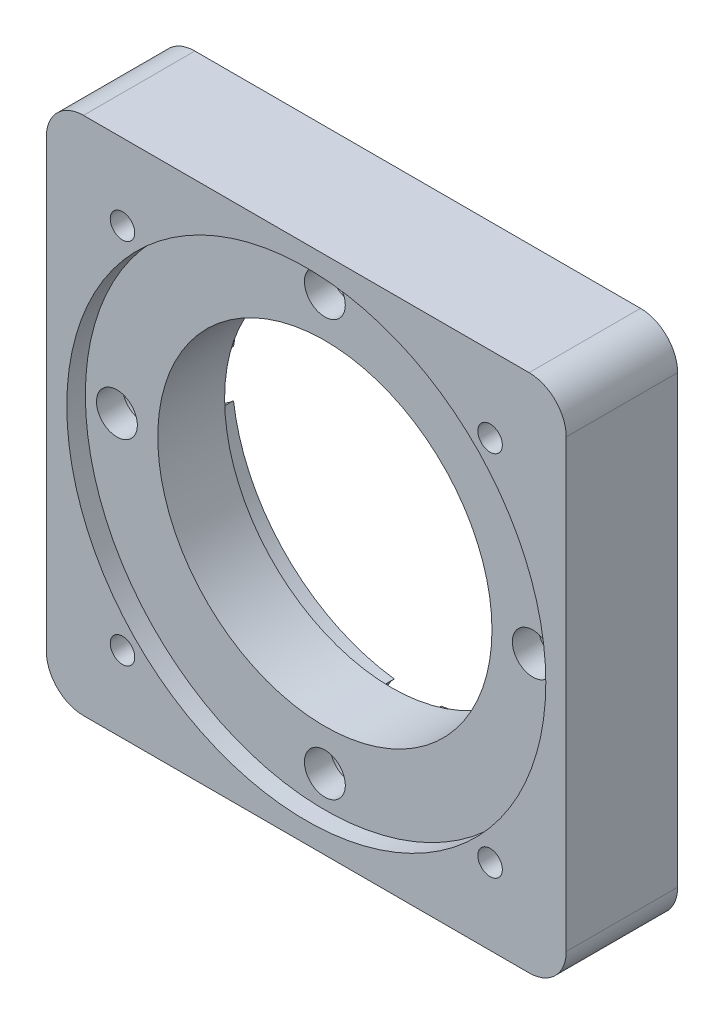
ISO-10303-21;
HEADER;
FILE_DESCRIPTION(('STEP AP214'),'2;1');
FILE_NAME('part.step','',(''),(''),'','','');
FILE_SCHEMA(('AUTOMOTIVE_DESIGN { 1 0 10303 214 1 1 1 1 }'));
ENDSEC;
DATA;
#1=APPLICATION_CONTEXT('core data for automotive mechanical design processes');
#2=APPLICATION_PROTOCOL_DEFINITION('international standard','automotive_design',2000,#1);
#3=PRODUCT_CONTEXT('',#1,'mechanical');
#4=PRODUCT('Part','Part','',(#3));
#5=PRODUCT_RELATED_PRODUCT_CATEGORY('part','',(#4));
#6=PRODUCT_DEFINITION_FORMATION('','',#4);
#7=PRODUCT_DEFINITION_CONTEXT('part definition',#1,'design');
#8=PRODUCT_DEFINITION('design','',#6,#7);
#9=PRODUCT_DEFINITION_SHAPE('','',#8);
#10=(LENGTH_UNIT() NAMED_UNIT(*) SI_UNIT(.MILLI.,.METRE.));
#11=(NAMED_UNIT(*) PLANE_ANGLE_UNIT() SI_UNIT($,.RADIAN.));
#12=(NAMED_UNIT(*) SI_UNIT($,.STERADIAN.) SOLID_ANGLE_UNIT());
#13=UNCERTAINTY_MEASURE_WITH_UNIT(LENGTH_MEASURE(1.E-05),#10,'distance_accuracy_value','');
#14=(GEOMETRIC_REPRESENTATION_CONTEXT(3) GLOBAL_UNCERTAINTY_ASSIGNED_CONTEXT((#13)) GLOBAL_UNIT_ASSIGNED_CONTEXT((#10,
#11,#12)) REPRESENTATION_CONTEXT('',''));
#15=CARTESIAN_POINT('',(0.,0.,0.));
#16=DIRECTION('',(0.,0.,1.));
#17=DIRECTION('',(1.,0.,0.));
#18=AXIS2_PLACEMENT_3D('',#15,#16,#17);
#19=CARTESIAN_POINT('',(28.,2.93284432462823E-13,0.));
#20=DIRECTION('',(0.,0.,1.));
#21=DIRECTION('',(1.,0.,0.));
#22=AXIS2_PLACEMENT_3D('',#19,#20,#21);
#23=CYLINDRICAL_SURFACE('',#22,2.75);
#24=CARTESIAN_POINT('',(28.,2.93284432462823E-13,12.5));
#25=DIRECTION('',(0.,0.,1.));
#26=DIRECTION('',(0.,-1.,0.));
#27=AXIS2_PLACEMENT_3D('',#24,#25,#26);
#28=CIRCLE('',#27,2.75);
#29=CARTESIAN_POINT('',(28.,-2.74999999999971,12.5));
#30=VERTEX_POINT('',#29);
#31=EDGE_CURVE('E188',#30,#30,#28,.T.);
#32=ORIENTED_EDGE('',*,*,#31,.T.);
#33=EDGE_LOOP('',(#32));
#34=FACE_BOUND('',#33,.T.);
#35=CARTESIAN_POINT('',(28.,2.93284432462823E-13,9.));
#36=DIRECTION('',(0.,0.,-1.));
#37=DIRECTION('',(-1.,0.,0.));
#38=AXIS2_PLACEMENT_3D('',#35,#36,#37);
#39=CIRCLE('',#38,2.75);
#40=CARTESIAN_POINT('',(25.25,2.93284432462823E-13,9.));
#41=VERTEX_POINT('',#40);
#42=EDGE_CURVE('E195',#41,#41,#39,.F.);
#43=ORIENTED_EDGE('',*,*,#42,.F.);
#44=EDGE_LOOP('',(#43));
#45=FACE_BOUND('',#44,.T.);
#46=ADVANCED_FACE('F38',(#34,#45),#23,.F.);
#47=CARTESIAN_POINT('',(0.,-28.,0.));
#48=DIRECTION('',(0.,0.,1.));
#49=DIRECTION('',(1.,0.,0.));
#50=AXIS2_PLACEMENT_3D('',#47,#48,#49);
#51=CYLINDRICAL_SURFACE('',#50,2.75);
#52=CARTESIAN_POINT('',(0.,-28.,12.5));
#53=DIRECTION('',(0.,0.,1.));
#54=DIRECTION('',(-1.,0.,0.));
#55=AXIS2_PLACEMENT_3D('',#52,#53,#54);
#56=CIRCLE('',#55,2.75);
#57=CARTESIAN_POINT('',(-2.75,-28.,12.5));
#58=VERTEX_POINT('',#57);
#59=EDGE_CURVE('E284',#58,#58,#56,.T.);
#60=ORIENTED_EDGE('',*,*,#59,.T.);
#61=EDGE_LOOP('',(#60));
#62=FACE_BOUND('',#61,.T.);
#63=CARTESIAN_POINT('',(0.,-28.,9.));
#64=DIRECTION('',(0.,0.,-1.));
#65=DIRECTION('',(-1.,0.,0.));
#66=AXIS2_PLACEMENT_3D('',#63,#64,#65);
#67=CIRCLE('',#66,2.75);
#68=CARTESIAN_POINT('',(-2.75,-28.,9.));
#69=VERTEX_POINT('',#68);
#70=EDGE_CURVE('E190',#69,#69,#67,.F.);
#71=ORIENTED_EDGE('',*,*,#70,.F.);
#72=EDGE_LOOP('',(#71));
#73=FACE_BOUND('',#72,.T.);
#74=ADVANCED_FACE('F334',(#62,#73),#51,.F.);
#75=CARTESIAN_POINT('',(-28.,0.,0.));
#76=DIRECTION('',(0.,0.,1.));
#77=DIRECTION('',(1.,0.,0.));
#78=AXIS2_PLACEMENT_3D('',#75,#76,#77);
#79=CYLINDRICAL_SURFACE('',#78,2.75);
#80=CARTESIAN_POINT('',(-28.,0.,12.5));
#81=DIRECTION('',(0.,0.,1.));
#82=DIRECTION('',(0.,1.,0.));
#83=AXIS2_PLACEMENT_3D('',#80,#81,#82);
#84=CIRCLE('',#83,2.75);
#85=CARTESIAN_POINT('',(-28.,2.7499999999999,12.5));
#86=VERTEX_POINT('',#85);
#87=EDGE_CURVE('E287',#86,#86,#84,.T.);
#88=ORIENTED_EDGE('',*,*,#87,.T.);
#89=EDGE_LOOP('',(#88));
#90=FACE_BOUND('',#89,.T.);
#91=CARTESIAN_POINT('',(-28.,0.,9.));
#92=DIRECTION('',(0.,0.,-1.));
#93=DIRECTION('',(-1.,0.,0.));
#94=AXIS2_PLACEMENT_3D('',#91,#92,#93);
#95=CIRCLE('',#94,2.75);
#96=CARTESIAN_POINT('',(-30.75,0.,9.));
#97=VERTEX_POINT('',#96);
#98=EDGE_CURVE('E185',#97,#97,#95,.F.);
#99=ORIENTED_EDGE('',*,*,#98,.F.);
#100=EDGE_LOOP('',(#99));
#101=FACE_BOUND('',#100,.T.);
#102=ADVANCED_FACE('F340',(#90,#101),#79,.F.);
#103=CARTESIAN_POINT('',(0.,28.,0.));
#104=DIRECTION('',(0.,0.,1.));
#105=DIRECTION('',(1.,0.,0.));
#106=AXIS2_PLACEMENT_3D('',#103,#104,#105);
#107=CYLINDRICAL_SURFACE('',#106,2.75);
#108=CARTESIAN_POINT('',(0.,28.,12.5));
#109=DIRECTION('',(0.,0.,1.));
#110=DIRECTION('',(1.,0.,0.));
#111=AXIS2_PLACEMENT_3D('',#108,#109,#110);
#112=CIRCLE('',#111,2.75);
#113=CARTESIAN_POINT('',(2.75,28.,12.5));
#114=VERTEX_POINT('',#113);
#115=EDGE_CURVE('E183',#114,#114,#112,.T.);
#116=ORIENTED_EDGE('',*,*,#115,.T.);
#117=EDGE_LOOP('',(#116));
#118=FACE_BOUND('',#117,.T.);
#119=CARTESIAN_POINT('',(0.,28.,9.));
#120=DIRECTION('',(0.,0.,-1.));
#121=DIRECTION('',(-1.,0.,0.));
#122=AXIS2_PLACEMENT_3D('',#119,#120,#121);
#123=CIRCLE('',#122,2.75);
#124=CARTESIAN_POINT('',(-2.75,28.,9.));
#125=VERTEX_POINT('',#124);
#126=EDGE_CURVE('E180',#125,#125,#123,.F.);
#127=ORIENTED_EDGE('',*,*,#126,.F.);
#128=EDGE_LOOP('',(#127));
#129=FACE_BOUND('',#128,.T.);
#130=ADVANCED_FACE('F350',(#118,#129),#107,.F.);
#131=CARTESIAN_POINT('',(30.,-30.,15.));
#132=DIRECTION('',(0.,0.,-1.));
#133=DIRECTION('',(-1.,0.,0.));
#134=AXIS2_PLACEMENT_3D('',#131,#132,#133);
#135=CYLINDRICAL_SURFACE('',#134,5.);
#136=CARTESIAN_POINT('',(30.,-30.,0.));
#137=DIRECTION('',(0.,0.,1.));
#138=DIRECTION('',(-1.,0.,0.));
#139=AXIS2_PLACEMENT_3D('',#136,#137,#138);
#140=CIRCLE('',#139,5.);
#141=CARTESIAN_POINT('',(30.,-35.,0.));
#142=VERTEX_POINT('',#141);
#143=CARTESIAN_POINT('',(35.,-30.,0.));
#144=VERTEX_POINT('',#143);
#145=EDGE_CURVE('E148',#142,#144,#140,.T.);
#146=ORIENTED_EDGE('',*,*,#145,.T.);
#147=DIRECTION('',(0.,0.,-1.));
#148=VECTOR('',#147,1.);
#149=CARTESIAN_POINT('',(35.,-30.,15.));
#150=LINE('',#149,#148);
#151=CARTESIAN_POINT('',(35.,-30.,15.));
#152=VERTEX_POINT('',#151);
#153=EDGE_CURVE('E177',#152,#144,#150,.T.);
#154=ORIENTED_EDGE('',*,*,#153,.F.);
#155=CARTESIAN_POINT('',(30.,-30.,15.));
#156=DIRECTION('',(0.,0.,1.));
#157=DIRECTION('',(-1.,0.,0.));
#158=AXIS2_PLACEMENT_3D('',#155,#156,#157);
#159=CIRCLE('',#158,5.);
#160=CARTESIAN_POINT('',(30.,-35.,15.));
#161=VERTEX_POINT('',#160);
#162=EDGE_CURVE('E164',#161,#152,#159,.T.);
#163=ORIENTED_EDGE('',*,*,#162,.F.);
#164=DIRECTION('',(0.,0.,-1.));
#165=VECTOR('',#164,1.);
#166=CARTESIAN_POINT('',(30.,-35.,15.));
#167=LINE('',#166,#165);
#168=EDGE_CURVE('E144',#161,#142,#167,.T.);
#169=ORIENTED_EDGE('',*,*,#168,.T.);
#170=EDGE_LOOP('',(#146,#154,#163,#169));
#171=FACE_BOUND('',#170,.T.);
#172=ADVANCED_FACE('F40',(#171),#135,.T.);
#173=CARTESIAN_POINT('',(35.,-30.,15.));
#174=DIRECTION('',(-1.,0.,0.));
#175=DIRECTION('',(0.,0.,1.));
#176=AXIS2_PLACEMENT_3D('',#173,#174,#175);
#177=PLANE('',#176);
#178=DIRECTION('',(0.,1.,0.));
#179=VECTOR('',#178,1.);
#180=CARTESIAN_POINT('',(35.,-30.,0.));
#181=LINE('',#180,#179);
#182=CARTESIAN_POINT('',(35.,30.,0.));
#183=VERTEX_POINT('',#182);
#184=EDGE_CURVE('E151',#144,#183,#181,.T.);
#185=ORIENTED_EDGE('',*,*,#184,.T.);
#186=DIRECTION('',(0.,0.,-1.));
#187=VECTOR('',#186,1.);
#188=CARTESIAN_POINT('',(35.,30.,15.));
#189=LINE('',#188,#187);
#190=CARTESIAN_POINT('',(35.,30.,15.));
#191=VERTEX_POINT('',#190);
#192=EDGE_CURVE('E174',#191,#183,#189,.T.);
#193=ORIENTED_EDGE('',*,*,#192,.F.);
#194=DIRECTION('',(0.,1.,0.));
#195=VECTOR('',#194,1.);
#196=CARTESIAN_POINT('',(35.,-30.,15.));
#197=LINE('',#196,#195);
#198=EDGE_CURVE('E105',#152,#191,#197,.T.);
#199=ORIENTED_EDGE('',*,*,#198,.F.);
#200=ORIENTED_EDGE('',*,*,#153,.T.);
#201=EDGE_LOOP('',(#185,#193,#199,#200));
#202=FACE_BOUND('',#201,.T.);
#203=ADVANCED_FACE('F322',(#202),#177,.F.);
#204=CARTESIAN_POINT('',(30.,30.,15.));
#205=DIRECTION('',(0.,0.,-1.));
#206=DIRECTION('',(-1.,0.,0.));
#207=AXIS2_PLACEMENT_3D('',#204,#205,#206);
#208=CYLINDRICAL_SURFACE('',#207,5.);
#209=CARTESIAN_POINT('',(30.,30.,0.));
#210=DIRECTION('',(0.,0.,1.));
#211=DIRECTION('',(1.,0.,0.));
#212=AXIS2_PLACEMENT_3D('',#209,#210,#211);
#213=CIRCLE('',#212,5.);
#214=CARTESIAN_POINT('',(30.,35.,0.));
#215=VERTEX_POINT('',#214);
#216=EDGE_CURVE('E154',#183,#215,#213,.T.);
#217=ORIENTED_EDGE('',*,*,#216,.T.);
#218=DIRECTION('',(0.,0.,-1.));
#219=VECTOR('',#218,1.);
#220=CARTESIAN_POINT('',(30.,35.,15.));
#221=LINE('',#220,#219);
#222=CARTESIAN_POINT('',(30.,35.,15.));
#223=VERTEX_POINT('',#222);
#224=EDGE_CURVE('E171',#223,#215,#221,.T.);
#225=ORIENTED_EDGE('',*,*,#224,.F.);
#226=CARTESIAN_POINT('',(30.,30.,15.));
#227=DIRECTION('',(0.,0.,1.));
#228=DIRECTION('',(1.,0.,0.));
#229=AXIS2_PLACEMENT_3D('',#226,#227,#228);
#230=CIRCLE('',#229,5.);
#231=EDGE_CURVE('E304',#191,#223,#230,.T.);
#232=ORIENTED_EDGE('',*,*,#231,.F.);
#233=ORIENTED_EDGE('',*,*,#192,.T.);
#234=EDGE_LOOP('',(#217,#225,#232,#233));
#235=FACE_BOUND('',#234,.T.);
#236=ADVANCED_FACE('F325',(#235),#208,.T.);
#237=CARTESIAN_POINT('',(-30.,35.,15.));
#238=DIRECTION('',(0.,-1.,0.));
#239=DIRECTION('',(0.,0.,-1.));
#240=AXIS2_PLACEMENT_3D('',#237,#238,#239);
#241=PLANE('',#240);
#242=DIRECTION('',(-1.,0.,0.));
#243=VECTOR('',#242,1.);
#244=CARTESIAN_POINT('',(-30.,35.,0.));
#245=LINE('',#244,#243);
#246=CARTESIAN_POINT('',(-30.,35.,0.));
#247=VERTEX_POINT('',#246);
#248=EDGE_CURVE('E156',#215,#247,#245,.T.);
#249=ORIENTED_EDGE('',*,*,#248,.T.);
#250=DIRECTION('',(0.,0.,-1.));
#251=VECTOR('',#250,1.);
#252=CARTESIAN_POINT('',(-30.,35.,15.));
#253=LINE('',#252,#251);
#254=CARTESIAN_POINT('',(-30.,35.,15.));
#255=VERTEX_POINT('',#254);
#256=EDGE_CURVE('E168',#255,#247,#253,.T.);
#257=ORIENTED_EDGE('',*,*,#256,.F.);
#258=DIRECTION('',(-1.,0.,0.));
#259=VECTOR('',#258,1.);
#260=CARTESIAN_POINT('',(-30.,35.,15.));
#261=LINE('',#260,#259);
#262=EDGE_CURVE('E306',#223,#255,#261,.T.);
#263=ORIENTED_EDGE('',*,*,#262,.F.);
#264=ORIENTED_EDGE('',*,*,#224,.T.);
#265=EDGE_LOOP('',(#249,#257,#263,#264));
#266=FACE_BOUND('',#265,.T.);
#267=ADVANCED_FACE('F312',(#266),#241,.F.);
#268=CARTESIAN_POINT('',(-30.,30.,15.));
#269=DIRECTION('',(0.,0.,-1.));
#270=DIRECTION('',(-1.,0.,0.));
#271=AXIS2_PLACEMENT_3D('',#268,#269,#270);
#272=CYLINDRICAL_SURFACE('',#271,5.);
#273=CARTESIAN_POINT('',(-30.,30.,0.));
#274=DIRECTION('',(0.,0.,1.));
#275=DIRECTION('',(-1.,0.,0.));
#276=AXIS2_PLACEMENT_3D('',#273,#274,#275);
#277=CIRCLE('',#276,5.);
#278=CARTESIAN_POINT('',(-35.,30.,0.));
#279=VERTEX_POINT('',#278);
#280=EDGE_CURVE('E158',#247,#279,#277,.T.);
#281=ORIENTED_EDGE('',*,*,#280,.T.);
#282=DIRECTION('',(0.,0.,-1.));
#283=VECTOR('',#282,1.);
#284=CARTESIAN_POINT('',(-35.,30.,15.));
#285=LINE('',#284,#283);
#286=CARTESIAN_POINT('',(-35.,30.,15.));
#287=VERTEX_POINT('',#286);
#288=EDGE_CURVE('E139',#287,#279,#285,.T.);
#289=ORIENTED_EDGE('',*,*,#288,.F.);
#290=CARTESIAN_POINT('',(-30.,30.,15.));
#291=DIRECTION('',(0.,0.,1.));
#292=DIRECTION('',(-1.,0.,0.));
#293=AXIS2_PLACEMENT_3D('',#290,#291,#292);
#294=CIRCLE('',#293,5.);
#295=EDGE_CURVE('E127',#255,#287,#294,.T.);
#296=ORIENTED_EDGE('',*,*,#295,.F.);
#297=ORIENTED_EDGE('',*,*,#256,.T.);
#298=EDGE_LOOP('',(#281,#289,#296,#297));
#299=FACE_BOUND('',#298,.T.);
#300=ADVANCED_FACE('F316',(#299),#272,.T.);
#301=CARTESIAN_POINT('',(-35.,-30.,15.));
#302=DIRECTION('',(1.,0.,0.));
#303=DIRECTION('',(0.,0.,-1.));
#304=AXIS2_PLACEMENT_3D('',#301,#302,#303);
#305=PLANE('',#304);
#306=DIRECTION('',(0.,-1.,0.));
#307=VECTOR('',#306,1.);
#308=CARTESIAN_POINT('',(-35.,-30.,0.));
#309=LINE('',#308,#307);
#310=CARTESIAN_POINT('',(-35.,-30.,0.));
#311=VERTEX_POINT('',#310);
#312=EDGE_CURVE('E136',#279,#311,#309,.T.);
#313=ORIENTED_EDGE('',*,*,#312,.T.);
#314=DIRECTION('',(0.,0.,-1.));
#315=VECTOR('',#314,1.);
#316=CARTESIAN_POINT('',(-35.,-30.,15.));
#317=LINE('',#316,#315);
#318=CARTESIAN_POINT('',(-35.,-30.,15.));
#319=VERTEX_POINT('',#318);
#320=EDGE_CURVE('E133',#319,#311,#317,.T.);
#321=ORIENTED_EDGE('',*,*,#320,.F.);
#322=DIRECTION('',(0.,-1.,0.));
#323=VECTOR('',#322,1.);
#324=CARTESIAN_POINT('',(-35.,-30.,15.));
#325=LINE('',#324,#323);
#326=EDGE_CURVE('E120',#287,#319,#325,.T.);
#327=ORIENTED_EDGE('',*,*,#326,.F.);
#328=ORIENTED_EDGE('',*,*,#288,.T.);
#329=EDGE_LOOP('',(#313,#321,#327,#328));
#330=FACE_BOUND('',#329,.T.);
#331=ADVANCED_FACE('F134',(#330),#305,.F.);
#332=CARTESIAN_POINT('',(-30.,-30.,15.));
#333=DIRECTION('',(0.,0.,-1.));
#334=DIRECTION('',(-1.,0.,0.));
#335=AXIS2_PLACEMENT_3D('',#332,#333,#334);
#336=CYLINDRICAL_SURFACE('',#335,5.);
#337=CARTESIAN_POINT('',(-30.,-30.,0.));
#338=DIRECTION('',(0.,0.,1.));
#339=DIRECTION('',(-1.,0.,0.));
#340=AXIS2_PLACEMENT_3D('',#337,#338,#339);
#341=CIRCLE('',#340,5.);
#342=CARTESIAN_POINT('',(-30.,-35.,0.));
#343=VERTEX_POINT('',#342);
#344=EDGE_CURVE('E161',#311,#343,#341,.T.);
#345=ORIENTED_EDGE('',*,*,#344,.T.);
#346=DIRECTION('',(0.,0.,-1.));
#347=VECTOR('',#346,1.);
#348=CARTESIAN_POINT('',(-30.,-35.,15.));
#349=LINE('',#348,#347);
#350=CARTESIAN_POINT('',(-30.,-35.,15.));
#351=VERTEX_POINT('',#350);
#352=EDGE_CURVE('E140',#351,#343,#349,.T.);
#353=ORIENTED_EDGE('',*,*,#352,.F.);
#354=CARTESIAN_POINT('',(-30.,-30.,15.));
#355=DIRECTION('',(0.,0.,1.));
#356=DIRECTION('',(-1.,0.,0.));
#357=AXIS2_PLACEMENT_3D('',#354,#355,#356);
#358=CIRCLE('',#357,5.);
#359=EDGE_CURVE('E124',#319,#351,#358,.T.);
#360=ORIENTED_EDGE('',*,*,#359,.F.);
#361=ORIENTED_EDGE('',*,*,#320,.T.);
#362=EDGE_LOOP('',(#345,#353,#360,#361));
#363=FACE_BOUND('',#362,.T.);
#364=ADVANCED_FACE('F142',(#363),#336,.T.);
#365=CARTESIAN_POINT('',(-30.,-35.,15.));
#366=DIRECTION('',(0.,1.,0.));
#367=DIRECTION('',(0.,0.,1.));
#368=AXIS2_PLACEMENT_3D('',#365,#366,#367);
#369=PLANE('',#368);
#370=DIRECTION('',(1.,0.,0.));
#371=VECTOR('',#370,1.);
#372=CARTESIAN_POINT('',(-30.,-35.,0.));
#373=LINE('',#372,#371);
#374=EDGE_CURVE('E96',#343,#142,#373,.T.);
#375=ORIENTED_EDGE('',*,*,#374,.T.);
#376=ORIENTED_EDGE('',*,*,#168,.F.);
#377=DIRECTION('',(1.,0.,0.));
#378=VECTOR('',#377,1.);
#379=CARTESIAN_POINT('',(-30.,-35.,15.));
#380=LINE('',#379,#378);
#381=EDGE_CURVE('E63',#351,#161,#380,.T.);
#382=ORIENTED_EDGE('',*,*,#381,.F.);
#383=ORIENTED_EDGE('',*,*,#352,.T.);
#384=EDGE_LOOP('',(#375,#376,#382,#383));
#385=FACE_BOUND('',#384,.T.);
#386=ADVANCED_FACE('F318',(#385),#369,.F.);
#387=CARTESIAN_POINT('',(30.,-30.,15.));
#388=DIRECTION('',(0.,0.,-1.));
#389=DIRECTION('',(-1.,0.,0.));
#390=AXIS2_PLACEMENT_3D('',#387,#388,#389);
#391=PLANE('',#390);
#392=CARTESIAN_POINT('',(-24.7487373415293,-24.748737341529,15.));
#393=DIRECTION('',(0.,0.,-1.));
#394=DIRECTION('',(-1.,0.,0.));
#395=AXIS2_PLACEMENT_3D('',#392,#393,#394);
#396=CIRCLE('',#395,1.65);
#397=CARTESIAN_POINT('',(-26.3987373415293,-24.748737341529,15.));
#398=VERTEX_POINT('',#397);
#399=EDGE_CURVE('E651',#398,#398,#396,.T.);
#400=ORIENTED_EDGE('',*,*,#399,.T.);
#401=EDGE_LOOP('',(#400));
#402=FACE_BOUND('',#401,.T.);
#403=CARTESIAN_POINT('',(24.7487373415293,-24.748737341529,15.));
#404=DIRECTION('',(0.,0.,-1.));
#405=DIRECTION('',(-1.,0.,0.));
#406=AXIS2_PLACEMENT_3D('',#403,#404,#405);
#407=CIRCLE('',#406,1.65);
#408=CARTESIAN_POINT('',(23.0987373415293,-24.748737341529,15.));
#409=VERTEX_POINT('',#408);
#410=EDGE_CURVE('E661',#409,#409,#407,.T.);
#411=ORIENTED_EDGE('',*,*,#410,.T.);
#412=EDGE_LOOP('',(#411));
#413=FACE_BOUND('',#412,.T.);
#414=CARTESIAN_POINT('',(24.7487373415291,24.7487373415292,15.));
#415=DIRECTION('',(0.,0.,-1.));
#416=DIRECTION('',(-1.,0.,0.));
#417=AXIS2_PLACEMENT_3D('',#414,#415,#416);
#418=CIRCLE('',#417,1.65);
#419=CARTESIAN_POINT('',(23.0987373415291,24.7487373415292,15.));
#420=VERTEX_POINT('',#419);
#421=EDGE_CURVE('E667',#420,#420,#418,.T.);
#422=ORIENTED_EDGE('',*,*,#421,.T.);
#423=EDGE_LOOP('',(#422));
#424=FACE_BOUND('',#423,.T.);
#425=CARTESIAN_POINT('',(-24.7487373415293,24.748737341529,15.));
#426=DIRECTION('',(0.,0.,-1.));
#427=DIRECTION('',(-1.,0.,0.));
#428=AXIS2_PLACEMENT_3D('',#425,#426,#427);
#429=CIRCLE('',#428,1.65);
#430=CARTESIAN_POINT('',(-26.3987373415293,24.748737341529,15.));
#431=VERTEX_POINT('',#430);
#432=EDGE_CURVE('E673',#431,#431,#429,.T.);
#433=ORIENTED_EDGE('',*,*,#432,.T.);
#434=EDGE_LOOP('',(#433));
#435=FACE_BOUND('',#434,.T.);
#436=CARTESIAN_POINT('',(0.,0.,15.));
#437=DIRECTION('',(0.,0.,1.));
#438=DIRECTION('',(1.,0.,0.));
#439=AXIS2_PLACEMENT_3D('',#436,#437,#438);
#440=CIRCLE('',#439,32.25);
#441=CARTESIAN_POINT('',(32.25,0.,15.));
#442=VERTEX_POINT('',#441);
#443=EDGE_CURVE('E297',#442,#442,#440,.T.);
#444=ORIENTED_EDGE('',*,*,#443,.F.);
#445=EDGE_LOOP('',(#444));
#446=FACE_BOUND('',#445,.T.);
#447=ORIENTED_EDGE('',*,*,#162,.T.);
#448=ORIENTED_EDGE('',*,*,#198,.T.);
#449=ORIENTED_EDGE('',*,*,#231,.T.);
#450=ORIENTED_EDGE('',*,*,#262,.T.);
#451=ORIENTED_EDGE('',*,*,#295,.T.);
#452=ORIENTED_EDGE('',*,*,#326,.T.);
#453=ORIENTED_EDGE('',*,*,#359,.T.);
#454=ORIENTED_EDGE('',*,*,#381,.T.);
#455=EDGE_LOOP('',(#447,#448,#449,#450,#451,#452,#453,#454));
#456=FACE_BOUND('',#455,.T.);
#457=ADVANCED_FACE('F122',(#402,#413,#424,#435,#446,#456),#391,.F.);
#458=CARTESIAN_POINT('',(30.,-30.,0.));
#459=DIRECTION('',(0.,0.,-1.));
#460=DIRECTION('',(-1.,0.,0.));
#461=AXIS2_PLACEMENT_3D('',#458,#459,#460);
#462=PLANE('',#461);
#463=CARTESIAN_POINT('',(-24.7487373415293,-24.748737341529,0.));
#464=DIRECTION('',(0.,0.,-1.));
#465=DIRECTION('',(-1.,0.,0.));
#466=AXIS2_PLACEMENT_3D('',#463,#464,#465);
#467=CIRCLE('',#466,1.65);
#468=CARTESIAN_POINT('',(-26.3987373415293,-24.748737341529,0.));
#469=VERTEX_POINT('',#468);
#470=EDGE_CURVE('E654',#469,#469,#467,.T.);
#471=ORIENTED_EDGE('',*,*,#470,.F.);
#472=EDGE_LOOP('',(#471));
#473=FACE_BOUND('',#472,.T.);
#474=CARTESIAN_POINT('',(24.7487373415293,-24.748737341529,0.));
#475=DIRECTION('',(0.,0.,-1.));
#476=DIRECTION('',(-1.,0.,0.));
#477=AXIS2_PLACEMENT_3D('',#474,#475,#476);
#478=CIRCLE('',#477,1.65);
#479=CARTESIAN_POINT('',(23.0987373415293,-24.748737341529,0.));
#480=VERTEX_POINT('',#479);
#481=EDGE_CURVE('E656',#480,#480,#478,.T.);
#482=ORIENTED_EDGE('',*,*,#481,.F.);
#483=EDGE_LOOP('',(#482));
#484=FACE_BOUND('',#483,.T.);
#485=CARTESIAN_POINT('',(24.7487373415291,24.7487373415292,0.));
#486=DIRECTION('',(0.,0.,-1.));
#487=DIRECTION('',(-1.,0.,0.));
#488=AXIS2_PLACEMENT_3D('',#485,#486,#487);
#489=CIRCLE('',#488,1.65);
#490=CARTESIAN_POINT('',(23.0987373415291,24.7487373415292,0.));
#491=VERTEX_POINT('',#490);
#492=EDGE_CURVE('E664',#491,#491,#489,.T.);
#493=ORIENTED_EDGE('',*,*,#492,.F.);
#494=EDGE_LOOP('',(#493));
#495=FACE_BOUND('',#494,.T.);
#496=CARTESIAN_POINT('',(-24.7487373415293,24.748737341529,0.));
#497=DIRECTION('',(0.,0.,-1.));
#498=DIRECTION('',(-1.,0.,0.));
#499=AXIS2_PLACEMENT_3D('',#496,#497,#498);
#500=CIRCLE('',#499,1.65);
#501=CARTESIAN_POINT('',(-26.3987373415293,24.748737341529,0.));
#502=VERTEX_POINT('',#501);
#503=EDGE_CURVE('E670',#502,#502,#500,.T.);
#504=ORIENTED_EDGE('',*,*,#503,.F.);
#505=EDGE_LOOP('',(#504));
#506=FACE_BOUND('',#505,.T.);
#507=CARTESIAN_POINT('',(0.,0.,0.));
#508=DIRECTION('',(0.,0.,-1.));
#509=DIRECTION('',(-1.,0.,0.));
#510=AXIS2_PLACEMENT_3D('',#507,#508,#509);
#511=CIRCLE('',#510,25.);
#512=CARTESIAN_POINT('',(-24.7991071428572,3.16295509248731,0.));
#513=VERTEX_POINT('',#512);
#514=CARTESIAN_POINT('',(-3.1629550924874,24.7991071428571,0.));
#515=VERTEX_POINT('',#514);
#516=EDGE_CURVE('E239',#513,#515,#511,.T.);
#517=ORIENTED_EDGE('',*,*,#516,.F.);
#518=CARTESIAN_POINT('',(-28.,0.,0.));
#519=DIRECTION('',(0.,0.,-1.));
#520=DIRECTION('',(0.,-1.,0.));
#521=AXIS2_PLACEMENT_3D('',#518,#519,#520);
#522=CIRCLE('',#521,4.5);
#523=CARTESIAN_POINT('',(-24.7991071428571,-3.16295509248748,0.));
#524=VERTEX_POINT('',#523);
#525=EDGE_CURVE('E193',#524,#513,#522,.T.);
#526=ORIENTED_EDGE('',*,*,#525,.F.);
#527=CARTESIAN_POINT('',(-3.1629550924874,-24.7991071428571,0.));
#528=VERTEX_POINT('',#527);
#529=EDGE_CURVE('E236',#528,#524,#511,.T.);
#530=ORIENTED_EDGE('',*,*,#529,.F.);
#531=CARTESIAN_POINT('',(0.,-28.,0.));
#532=DIRECTION('',(0.,0.,-1.));
#533=DIRECTION('',(1.,0.,0.));
#534=AXIS2_PLACEMENT_3D('',#531,#532,#533);
#535=CIRCLE('',#534,4.5);
#536=CARTESIAN_POINT('',(3.1629550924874,-24.7991071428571,0.));
#537=VERTEX_POINT('',#536);
#538=EDGE_CURVE('E198',#537,#528,#535,.T.);
#539=ORIENTED_EDGE('',*,*,#538,.F.);
#540=CARTESIAN_POINT('',(24.7991071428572,-3.16295509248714,0.));
#541=VERTEX_POINT('',#540);
#542=EDGE_CURVE('E221',#541,#537,#511,.T.);
#543=ORIENTED_EDGE('',*,*,#542,.F.);
#544=CARTESIAN_POINT('',(28.,2.93284432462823E-13,0.));
#545=DIRECTION('',(0.,0.,-1.));
#546=DIRECTION('',(0.,1.,0.));
#547=AXIS2_PLACEMENT_3D('',#544,#545,#546);
#548=CIRCLE('',#547,4.5);
#549=CARTESIAN_POINT('',(24.7991071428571,3.16295509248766,0.));
#550=VERTEX_POINT('',#549);
#551=EDGE_CURVE('E210',#550,#541,#548,.T.);
#552=ORIENTED_EDGE('',*,*,#551,.F.);
#553=CARTESIAN_POINT('',(3.1629550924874,24.7991071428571,0.));
#554=VERTEX_POINT('',#553);
#555=EDGE_CURVE('E235',#554,#550,#511,.T.);
#556=ORIENTED_EDGE('',*,*,#555,.F.);
#557=CARTESIAN_POINT('',(0.,28.,0.));
#558=DIRECTION('',(0.,0.,-1.));
#559=DIRECTION('',(-1.,0.,0.));
#560=AXIS2_PLACEMENT_3D('',#557,#558,#559);
#561=CIRCLE('',#560,4.5);
#562=EDGE_CURVE('E290',#515,#554,#561,.T.);
#563=ORIENTED_EDGE('',*,*,#562,.F.);
#564=EDGE_LOOP('',(#517,#526,#530,#539,#543,#552,#556,#563));
#565=FACE_BOUND('',#564,.T.);
#566=ORIENTED_EDGE('',*,*,#145,.F.);
#567=ORIENTED_EDGE('',*,*,#374,.F.);
#568=ORIENTED_EDGE('',*,*,#344,.F.);
#569=ORIENTED_EDGE('',*,*,#312,.F.);
#570=ORIENTED_EDGE('',*,*,#280,.F.);
#571=ORIENTED_EDGE('',*,*,#248,.F.);
#572=ORIENTED_EDGE('',*,*,#216,.F.);
#573=ORIENTED_EDGE('',*,*,#184,.F.);
#574=EDGE_LOOP('',(#566,#567,#568,#569,#570,#571,#572,#573));
#575=FACE_BOUND('',#574,.T.);
#576=ADVANCED_FACE('F230',(#473,#484,#495,#506,#565,#575),#462,.T.);
#577=CARTESIAN_POINT('',(0.,0.,12.5));
#578=DIRECTION('',(0.,0.,1.));
#579=DIRECTION('',(1.,0.,0.));
#580=AXIS2_PLACEMENT_3D('',#577,#578,#579);
#581=CYLINDRICAL_SURFACE('',#580,32.25);
#582=CARTESIAN_POINT('',(0.,0.,12.5));
#583=DIRECTION('',(0.,0.,1.));
#584=DIRECTION('',(1.,0.,0.));
#585=AXIS2_PLACEMENT_3D('',#582,#583,#584);
#586=CIRCLE('',#585,32.25);
#587=CARTESIAN_POINT('',(32.25,0.,12.5));
#588=VERTEX_POINT('',#587);
#589=EDGE_CURVE('E152',#588,#588,#586,.T.);
#590=ORIENTED_EDGE('',*,*,#589,.F.);
#591=EDGE_LOOP('',(#590));
#592=FACE_BOUND('',#591,.T.);
#593=ORIENTED_EDGE('',*,*,#443,.T.);
#594=EDGE_LOOP('',(#593));
#595=FACE_BOUND('',#594,.T.);
#596=ADVANCED_FACE('F367',(#592,#595),#581,.F.);
#597=CARTESIAN_POINT('',(0.,0.,12.5));
#598=DIRECTION('',(0.,0.,1.));
#599=DIRECTION('',(1.,0.,0.));
#600=AXIS2_PLACEMENT_3D('',#597,#598,#599);
#601=PLANE('',#600);
#602=CARTESIAN_POINT('',(0.,0.,12.5));
#603=DIRECTION('',(0.,0.,1.));
#604=DIRECTION('',(1.,0.,0.));
#605=AXIS2_PLACEMENT_3D('',#602,#603,#604);
#606=CIRCLE('',#605,22.5);
#607=CARTESIAN_POINT('',(22.5,0.,12.5));
#608=VERTEX_POINT('',#607);
#609=EDGE_CURVE('E675',#608,#608,#606,.T.);
#610=ORIENTED_EDGE('',*,*,#609,.F.);
#611=EDGE_LOOP('',(#610));
#612=FACE_BOUND('',#611,.T.);
#613=ORIENTED_EDGE('',*,*,#31,.F.);
#614=EDGE_LOOP('',(#613));
#615=FACE_BOUND('',#614,.T.);
#616=ORIENTED_EDGE('',*,*,#59,.F.);
#617=EDGE_LOOP('',(#616));
#618=FACE_BOUND('',#617,.T.);
#619=ORIENTED_EDGE('',*,*,#87,.F.);
#620=EDGE_LOOP('',(#619));
#621=FACE_BOUND('',#620,.T.);
#622=ORIENTED_EDGE('',*,*,#115,.F.);
#623=EDGE_LOOP('',(#622));
#624=FACE_BOUND('',#623,.T.);
#625=ORIENTED_EDGE('',*,*,#589,.T.);
#626=EDGE_LOOP('',(#625));
#627=FACE_BOUND('',#626,.T.);
#628=ADVANCED_FACE('F356',(#612,#615,#618,#621,#624,#627),#601,.T.);
#629=CARTESIAN_POINT('',(0.,28.,9.));
#630=DIRECTION('',(0.,0.,-1.));
#631=DIRECTION('',(-1.,0.,0.));
#632=AXIS2_PLACEMENT_3D('',#629,#630,#631);
#633=PLANE('',#632);
#634=CARTESIAN_POINT('',(0.,28.,9.));
#635=DIRECTION('',(0.,0.,-1.));
#636=DIRECTION('',(-1.,0.,0.));
#637=AXIS2_PLACEMENT_3D('',#634,#635,#636);
#638=CIRCLE('',#637,4.5);
#639=CARTESIAN_POINT('',(-4.5,28.,9.));
#640=VERTEX_POINT('',#639);
#641=EDGE_CURVE('E184',#640,#640,#638,.T.);
#642=ORIENTED_EDGE('',*,*,#641,.T.);
#643=EDGE_LOOP('',(#642));
#644=FACE_BOUND('',#643,.T.);
#645=ORIENTED_EDGE('',*,*,#126,.T.);
#646=EDGE_LOOP('',(#645));
#647=FACE_BOUND('',#646,.T.);
#648=ADVANCED_FACE('F352',(#644,#647),#633,.T.);
#649=CARTESIAN_POINT('',(0.,28.,9.));
#650=DIRECTION('',(0.,0.,-1.));
#651=DIRECTION('',(-1.,0.,0.));
#652=AXIS2_PLACEMENT_3D('',#649,#650,#651);
#653=CYLINDRICAL_SURFACE('',#652,4.5);
#654=ORIENTED_EDGE('',*,*,#641,.F.);
#655=EDGE_LOOP('',(#654));
#656=FACE_BOUND('',#655,.T.);
#657=CARTESIAN_POINT('',(0.,28.,3.5));
#658=DIRECTION('',(0.,0.,-1.));
#659=DIRECTION('',(-1.,0.,0.));
#660=AXIS2_PLACEMENT_3D('',#657,#658,#659);
#661=CIRCLE('',#660,4.5);
#662=CARTESIAN_POINT('',(-3.1629550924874,24.7991071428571,3.5));
#663=VERTEX_POINT('',#662);
#664=CARTESIAN_POINT('',(3.1629550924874,24.7991071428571,3.5));
#665=VERTEX_POINT('',#664);
#666=EDGE_CURVE('E253',#663,#665,#661,.F.);
#667=ORIENTED_EDGE('',*,*,#666,.F.);
#668=DIRECTION('',(0.,0.,-1.));
#669=VECTOR('',#668,1.);
#670=CARTESIAN_POINT('',(-3.16295509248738,24.7991071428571,1.75));
#671=LINE('',#670,#669);
#672=EDGE_CURVE('E269',#663,#515,#671,.T.);
#673=ORIENTED_EDGE('',*,*,#672,.T.);
#674=ORIENTED_EDGE('',*,*,#562,.T.);
#675=DIRECTION('',(0.,0.,-1.));
#676=VECTOR('',#675,1.);
#677=CARTESIAN_POINT('',(3.16295509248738,24.7991071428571,1.75));
#678=LINE('',#677,#676);
#679=EDGE_CURVE('E266',#554,#665,#678,.F.);
#680=ORIENTED_EDGE('',*,*,#679,.T.);
#681=EDGE_LOOP('',(#667,#673,#674,#680));
#682=FACE_BOUND('',#681,.T.);
#683=ADVANCED_FACE('F355',(#656,#682),#653,.F.);
#684=CARTESIAN_POINT('',(-28.,0.,9.));
#685=DIRECTION('',(0.,0.,-1.));
#686=DIRECTION('',(0.,-1.,0.));
#687=AXIS2_PLACEMENT_3D('',#684,#685,#686);
#688=PLANE('',#687);
#689=CARTESIAN_POINT('',(-28.,0.,9.));
#690=DIRECTION('',(0.,0.,-1.));
#691=DIRECTION('',(0.,-1.,0.));
#692=AXIS2_PLACEMENT_3D('',#689,#690,#691);
#693=CIRCLE('',#692,4.5);
#694=CARTESIAN_POINT('',(-28.,-4.5000000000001,9.));
#695=VERTEX_POINT('',#694);
#696=EDGE_CURVE('E189',#695,#695,#693,.T.);
#697=ORIENTED_EDGE('',*,*,#696,.T.);
#698=EDGE_LOOP('',(#697));
#699=FACE_BOUND('',#698,.T.);
#700=ORIENTED_EDGE('',*,*,#98,.T.);
#701=EDGE_LOOP('',(#700));
#702=FACE_BOUND('',#701,.T.);
#703=ADVANCED_FACE('F360',(#699,#702),#688,.T.);
#704=CARTESIAN_POINT('',(-28.,0.,9.));
#705=DIRECTION('',(0.,0.,-1.));
#706=DIRECTION('',(-1.,0.,0.));
#707=AXIS2_PLACEMENT_3D('',#704,#705,#706);
#708=CYLINDRICAL_SURFACE('',#707,4.5);
#709=ORIENTED_EDGE('',*,*,#696,.F.);
#710=EDGE_LOOP('',(#709));
#711=FACE_BOUND('',#710,.T.);
#712=CARTESIAN_POINT('',(-28.,0.,3.5));
#713=DIRECTION('',(0.,0.,-1.));
#714=DIRECTION('',(-1.,0.,0.));
#715=AXIS2_PLACEMENT_3D('',#712,#713,#714);
#716=CIRCLE('',#715,4.5);
#717=CARTESIAN_POINT('',(-24.7991071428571,-3.16295509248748,3.5));
#718=VERTEX_POINT('',#717);
#719=CARTESIAN_POINT('',(-24.7991071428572,3.16295509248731,3.5));
#720=VERTEX_POINT('',#719);
#721=EDGE_CURVE('E250',#718,#720,#716,.F.);
#722=ORIENTED_EDGE('',*,*,#721,.F.);
#723=DIRECTION('',(0.,0.,-1.));
#724=VECTOR('',#723,1.);
#725=CARTESIAN_POINT('',(-24.7991071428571,-3.16295509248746,1.75));
#726=LINE('',#725,#724);
#727=EDGE_CURVE('E263',#718,#524,#726,.T.);
#728=ORIENTED_EDGE('',*,*,#727,.T.);
#729=ORIENTED_EDGE('',*,*,#525,.T.);
#730=DIRECTION('',(0.,0.,-1.));
#731=VECTOR('',#730,1.);
#732=CARTESIAN_POINT('',(-24.7991071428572,3.16295509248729,1.75));
#733=LINE('',#732,#731);
#734=EDGE_CURVE('E260',#513,#720,#733,.F.);
#735=ORIENTED_EDGE('',*,*,#734,.T.);
#736=EDGE_LOOP('',(#722,#728,#729,#735));
#737=FACE_BOUND('',#736,.T.);
#738=ADVANCED_FACE('F345',(#711,#737),#708,.F.);
#739=CARTESIAN_POINT('',(0.,-28.,9.));
#740=DIRECTION('',(0.,0.,-1.));
#741=DIRECTION('',(1.,0.,0.));
#742=AXIS2_PLACEMENT_3D('',#739,#740,#741);
#743=PLANE('',#742);
#744=CARTESIAN_POINT('',(0.,-28.,9.));
#745=DIRECTION('',(0.,0.,-1.));
#746=DIRECTION('',(1.,0.,0.));
#747=AXIS2_PLACEMENT_3D('',#744,#745,#746);
#748=CIRCLE('',#747,4.5);
#749=CARTESIAN_POINT('',(4.5,-28.,9.));
#750=VERTEX_POINT('',#749);
#751=EDGE_CURVE('E194',#750,#750,#748,.T.);
#752=ORIENTED_EDGE('',*,*,#751,.T.);
#753=EDGE_LOOP('',(#752));
#754=FACE_BOUND('',#753,.T.);
#755=ORIENTED_EDGE('',*,*,#70,.T.);
#756=EDGE_LOOP('',(#755));
#757=FACE_BOUND('',#756,.T.);
#758=ADVANCED_FACE('F445',(#754,#757),#743,.T.);
#759=CARTESIAN_POINT('',(0.,-28.,9.));
#760=DIRECTION('',(0.,0.,-1.));
#761=DIRECTION('',(-1.,0.,0.));
#762=AXIS2_PLACEMENT_3D('',#759,#760,#761);
#763=CYLINDRICAL_SURFACE('',#762,4.5);
#764=ORIENTED_EDGE('',*,*,#751,.F.);
#765=EDGE_LOOP('',(#764));
#766=FACE_BOUND('',#765,.T.);
#767=CARTESIAN_POINT('',(0.,-28.,3.5));
#768=DIRECTION('',(0.,0.,-1.));
#769=DIRECTION('',(-1.,0.,0.));
#770=AXIS2_PLACEMENT_3D('',#767,#768,#769);
#771=CIRCLE('',#770,4.5);
#772=CARTESIAN_POINT('',(3.1629550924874,-24.7991071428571,3.5));
#773=VERTEX_POINT('',#772);
#774=CARTESIAN_POINT('',(-3.1629550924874,-24.7991071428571,3.5));
#775=VERTEX_POINT('',#774);
#776=EDGE_CURVE('E247',#773,#775,#771,.F.);
#777=ORIENTED_EDGE('',*,*,#776,.F.);
#778=DIRECTION('',(0.,0.,-1.));
#779=VECTOR('',#778,1.);
#780=CARTESIAN_POINT('',(3.16295509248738,-24.7991071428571,1.75));
#781=LINE('',#780,#779);
#782=EDGE_CURVE('E258',#773,#537,#781,.T.);
#783=ORIENTED_EDGE('',*,*,#782,.T.);
#784=ORIENTED_EDGE('',*,*,#538,.T.);
#785=DIRECTION('',(0.,0.,-1.));
#786=VECTOR('',#785,1.);
#787=CARTESIAN_POINT('',(-3.16295509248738,-24.7991071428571,1.75));
#788=LINE('',#787,#786);
#789=EDGE_CURVE('E255',#528,#775,#788,.F.);
#790=ORIENTED_EDGE('',*,*,#789,.T.);
#791=EDGE_LOOP('',(#777,#783,#784,#790));
#792=FACE_BOUND('',#791,.T.);
#793=ADVANCED_FACE('F452',(#766,#792),#763,.F.);
#794=CARTESIAN_POINT('',(28.,2.93284432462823E-13,9.));
#795=DIRECTION('',(0.,0.,-1.));
#796=DIRECTION('',(0.,1.,0.));
#797=AXIS2_PLACEMENT_3D('',#794,#795,#796);
#798=PLANE('',#797);
#799=CARTESIAN_POINT('',(28.,2.93284432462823E-13,9.));
#800=DIRECTION('',(0.,0.,-1.));
#801=DIRECTION('',(0.,1.,0.));
#802=AXIS2_PLACEMENT_3D('',#799,#800,#801);
#803=CIRCLE('',#802,4.5);
#804=CARTESIAN_POINT('',(28.,4.50000000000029,9.));
#805=VERTEX_POINT('',#804);
#806=EDGE_CURVE('E199',#805,#805,#803,.T.);
#807=ORIENTED_EDGE('',*,*,#806,.T.);
#808=EDGE_LOOP('',(#807));
#809=FACE_BOUND('',#808,.T.);
#810=ORIENTED_EDGE('',*,*,#42,.T.);
#811=EDGE_LOOP('',(#810));
#812=FACE_BOUND('',#811,.T.);
#813=ADVANCED_FACE('F459',(#809,#812),#798,.T.);
#814=CARTESIAN_POINT('',(28.,2.93284432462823E-13,9.));
#815=DIRECTION('',(0.,0.,-1.));
#816=DIRECTION('',(-1.,0.,0.));
#817=AXIS2_PLACEMENT_3D('',#814,#815,#816);
#818=CYLINDRICAL_SURFACE('',#817,4.5);
#819=ORIENTED_EDGE('',*,*,#806,.F.);
#820=EDGE_LOOP('',(#819));
#821=FACE_BOUND('',#820,.T.);
#822=CARTESIAN_POINT('',(28.,2.93284432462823E-13,3.5));
#823=DIRECTION('',(0.,0.,-1.));
#824=DIRECTION('',(-1.,0.,0.));
#825=AXIS2_PLACEMENT_3D('',#822,#823,#824);
#826=CIRCLE('',#825,4.5);
#827=CARTESIAN_POINT('',(24.7991071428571,3.16295509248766,3.5));
#828=VERTEX_POINT('',#827);
#829=CARTESIAN_POINT('',(24.7991071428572,-3.16295509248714,3.5));
#830=VERTEX_POINT('',#829);
#831=EDGE_CURVE('E179',#828,#830,#826,.F.);
#832=ORIENTED_EDGE('',*,*,#831,.F.);
#833=DIRECTION('',(0.,0.,-1.));
#834=VECTOR('',#833,1.);
#835=CARTESIAN_POINT('',(24.7991071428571,3.16295509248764,1.75));
#836=LINE('',#835,#834);
#837=EDGE_CURVE('E11',#828,#550,#836,.T.);
#838=ORIENTED_EDGE('',*,*,#837,.T.);
#839=ORIENTED_EDGE('',*,*,#551,.T.);
#840=DIRECTION('',(0.,0.,-1.));
#841=VECTOR('',#840,1.);
#842=CARTESIAN_POINT('',(24.7991071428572,-3.16295509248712,1.75));
#843=LINE('',#842,#841);
#844=EDGE_CURVE('E47',#541,#830,#843,.F.);
#845=ORIENTED_EDGE('',*,*,#844,.T.);
#846=EDGE_LOOP('',(#832,#838,#839,#845));
#847=FACE_BOUND('',#846,.T.);
#848=ADVANCED_FACE('F207',(#821,#847),#818,.F.);
#849=CARTESIAN_POINT('',(0.,0.,3.5));
#850=DIRECTION('',(0.,0.,-1.));
#851=DIRECTION('',(-1.,0.,0.));
#852=AXIS2_PLACEMENT_3D('',#849,#850,#851);
#853=CYLINDRICAL_SURFACE('',#852,25.);
#854=CARTESIAN_POINT('',(0.,0.,3.5));
#855=DIRECTION('',(0.,0.,-1.));
#856=DIRECTION('',(-1.,0.,0.));
#857=AXIS2_PLACEMENT_3D('',#854,#855,#856);
#858=CIRCLE('',#857,25.);
#859=EDGE_CURVE('E245',#720,#663,#858,.T.);
#860=ORIENTED_EDGE('',*,*,#859,.F.);
#861=ORIENTED_EDGE('',*,*,#734,.F.);
#862=ORIENTED_EDGE('',*,*,#516,.T.);
#863=ORIENTED_EDGE('',*,*,#672,.F.);
#864=EDGE_LOOP('',(#860,#861,#862,#863));
#865=FACE_BOUND('',#864,.T.);
#866=ADVANCED_FACE('F473',(#865),#853,.F.);
#867=ORIENTED_EDGE('',*,*,#555,.T.);
#868=ORIENTED_EDGE('',*,*,#837,.F.);
#869=EDGE_CURVE('E54',#665,#828,#858,.T.);
#870=ORIENTED_EDGE('',*,*,#869,.F.);
#871=ORIENTED_EDGE('',*,*,#679,.F.);
#872=EDGE_LOOP('',(#867,#868,#870,#871));
#873=FACE_BOUND('',#872,.T.);
#874=ADVANCED_FACE('F481',(#873),#853,.F.);
#875=EDGE_CURVE('E244',#775,#718,#858,.T.);
#876=ORIENTED_EDGE('',*,*,#875,.F.);
#877=ORIENTED_EDGE('',*,*,#789,.F.);
#878=ORIENTED_EDGE('',*,*,#529,.T.);
#879=ORIENTED_EDGE('',*,*,#727,.F.);
#880=EDGE_LOOP('',(#876,#877,#878,#879));
#881=FACE_BOUND('',#880,.T.);
#882=ADVANCED_FACE('F489',(#881),#853,.F.);
#883=EDGE_CURVE('E224',#830,#773,#858,.T.);
#884=ORIENTED_EDGE('',*,*,#883,.F.);
#885=ORIENTED_EDGE('',*,*,#844,.F.);
#886=ORIENTED_EDGE('',*,*,#542,.T.);
#887=ORIENTED_EDGE('',*,*,#782,.F.);
#888=EDGE_LOOP('',(#884,#885,#886,#887));
#889=FACE_BOUND('',#888,.T.);
#890=ADVANCED_FACE('F218',(#889),#853,.F.);
#891=CARTESIAN_POINT('',(0.,0.,3.5));
#892=DIRECTION('',(0.,0.,-1.));
#893=DIRECTION('',(-1.,0.,0.));
#894=AXIS2_PLACEMENT_3D('',#891,#892,#893);
#895=PLANE('',#894);
#896=CARTESIAN_POINT('',(0.,0.,3.5));
#897=DIRECTION('',(0.,0.,-1.));
#898=DIRECTION('',(-1.,0.,0.));
#899=AXIS2_PLACEMENT_3D('',#896,#897,#898);
#900=CIRCLE('',#899,22.5);
#901=CARTESIAN_POINT('',(-22.5,0.,3.5));
#902=VERTEX_POINT('',#901);
#903=EDGE_CURVE('E42',#902,#902,#900,.T.);
#904=ORIENTED_EDGE('',*,*,#903,.F.);
#905=EDGE_LOOP('',(#904));
#906=FACE_BOUND('',#905,.T.);
#907=ORIENTED_EDGE('',*,*,#666,.T.);
#908=ORIENTED_EDGE('',*,*,#869,.T.);
#909=ORIENTED_EDGE('',*,*,#831,.T.);
#910=ORIENTED_EDGE('',*,*,#883,.T.);
#911=ORIENTED_EDGE('',*,*,#776,.T.);
#912=ORIENTED_EDGE('',*,*,#875,.T.);
#913=ORIENTED_EDGE('',*,*,#721,.T.);
#914=ORIENTED_EDGE('',*,*,#859,.T.);
#915=EDGE_LOOP('',(#907,#908,#909,#910,#911,#912,#913,#914));
#916=FACE_BOUND('',#915,.T.);
#917=ADVANCED_FACE('F501',(#906,#916),#895,.T.);
#918=CARTESIAN_POINT('',(0.,0.,-1.));
#919=DIRECTION('',(0.,0.,1.));
#920=DIRECTION('',(1.,0.,0.));
#921=AXIS2_PLACEMENT_3D('',#918,#919,#920);
#922=CYLINDRICAL_SURFACE('',#921,22.5);
#923=ORIENTED_EDGE('',*,*,#903,.T.);
#924=EDGE_LOOP('',(#923));
#925=FACE_BOUND('',#924,.T.);
#926=ORIENTED_EDGE('',*,*,#609,.T.);
#927=EDGE_LOOP('',(#926));
#928=FACE_BOUND('',#927,.T.);
#929=ADVANCED_FACE('F506',(#925,#928),#922,.F.);
#930=CARTESIAN_POINT('',(-24.7487373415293,24.748737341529,0.));
#931=DIRECTION('',(0.,0.,-1.));
#932=DIRECTION('',(-1.,0.,0.));
#933=AXIS2_PLACEMENT_3D('',#930,#931,#932);
#934=CYLINDRICAL_SURFACE('',#933,1.65);
#935=ORIENTED_EDGE('',*,*,#432,.F.);
#936=EDGE_LOOP('',(#935));
#937=FACE_BOUND('',#936,.T.);
#938=ORIENTED_EDGE('',*,*,#503,.T.);
#939=EDGE_LOOP('',(#938));
#940=FACE_BOUND('',#939,.T.);
#941=ADVANCED_FACE('F514',(#937,#940),#934,.F.);
#942=CARTESIAN_POINT('',(24.7487373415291,24.7487373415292,0.));
#943=DIRECTION('',(0.,0.,-1.));
#944=DIRECTION('',(-1.,0.,0.));
#945=AXIS2_PLACEMENT_3D('',#942,#943,#944);
#946=CYLINDRICAL_SURFACE('',#945,1.65);
#947=ORIENTED_EDGE('',*,*,#421,.F.);
#948=EDGE_LOOP('',(#947));
#949=FACE_BOUND('',#948,.T.);
#950=ORIENTED_EDGE('',*,*,#492,.T.);
#951=EDGE_LOOP('',(#950));
#952=FACE_BOUND('',#951,.T.);
#953=ADVANCED_FACE('F522',(#949,#952),#946,.F.);
#954=CARTESIAN_POINT('',(24.7487373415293,-24.748737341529,0.));
#955=DIRECTION('',(0.,0.,-1.));
#956=DIRECTION('',(-1.,0.,0.));
#957=AXIS2_PLACEMENT_3D('',#954,#955,#956);
#958=CYLINDRICAL_SURFACE('',#957,1.65);
#959=ORIENTED_EDGE('',*,*,#410,.F.);
#960=EDGE_LOOP('',(#959));
#961=FACE_BOUND('',#960,.T.);
#962=ORIENTED_EDGE('',*,*,#481,.T.);
#963=EDGE_LOOP('',(#962));
#964=FACE_BOUND('',#963,.T.);
#965=ADVANCED_FACE('F530',(#961,#964),#958,.F.);
#966=CARTESIAN_POINT('',(-24.7487373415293,-24.748737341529,0.));
#967=DIRECTION('',(0.,0.,-1.));
#968=DIRECTION('',(-1.,0.,0.));
#969=AXIS2_PLACEMENT_3D('',#966,#967,#968);
#970=CYLINDRICAL_SURFACE('',#969,1.65);
#971=ORIENTED_EDGE('',*,*,#399,.F.);
#972=EDGE_LOOP('',(#971));
#973=FACE_BOUND('',#972,.T.);
#974=ORIENTED_EDGE('',*,*,#470,.T.);
#975=EDGE_LOOP('',(#974));
#976=FACE_BOUND('',#975,.T.);
#977=ADVANCED_FACE('F537',(#973,#976),#970,.F.);
#978=CLOSED_SHELL('',(#46,#74,#102,#130,#172,#203,#236,#267,#300,#331,#364,#386,#457,#576,#596,
#628,#648,#683,#703,#738,#758,#793,#813,#848,#866,#874,#882,#890,#917,#929,#941,#953,#965,#977));
#979=MANIFOLD_SOLID_BREP('B2',#978);
#980=ADVANCED_BREP_SHAPE_REPRESENTATION('',(#18,#979),#14);
#981=SHAPE_DEFINITION_REPRESENTATION(#9,#980);
ENDSEC;
END-ISO-10303-21;
